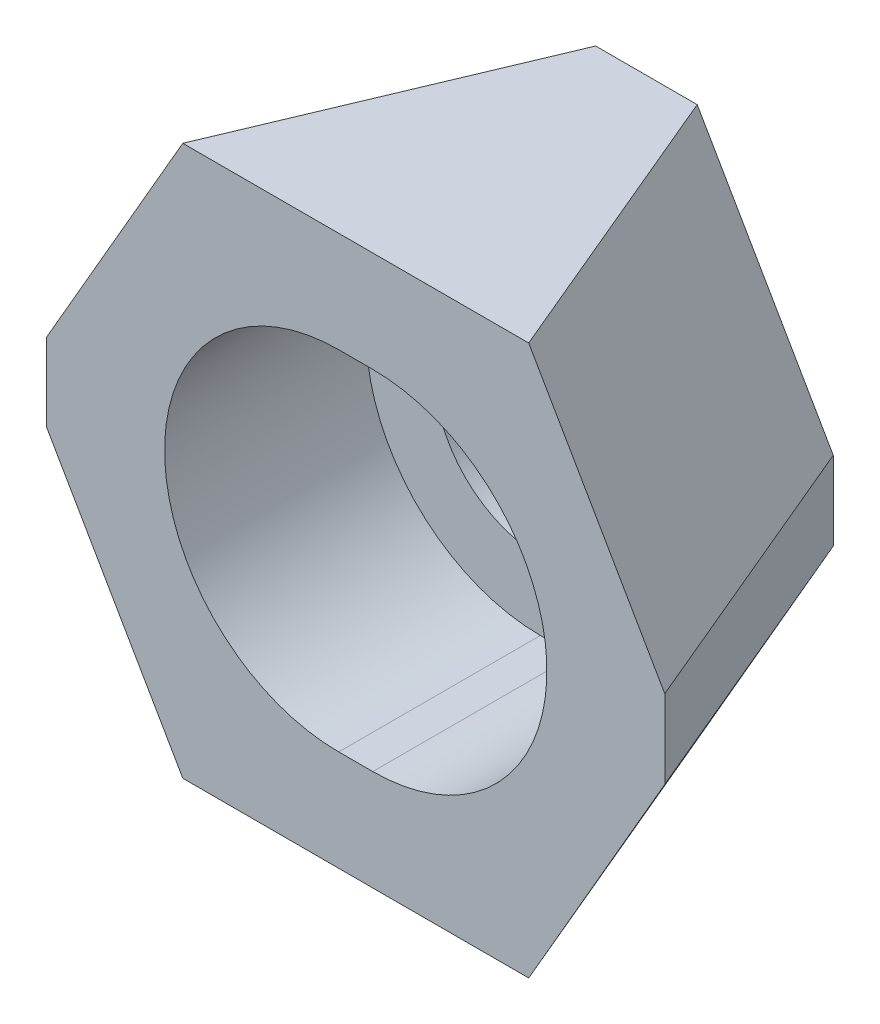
ISO-10303-21;
HEADER;
FILE_DESCRIPTION(('STEP AP214'),'2;1');
FILE_NAME('part.step','',(''),(''),'','','');
FILE_SCHEMA(('AUTOMOTIVE_DESIGN { 1 0 10303 214 1 1 1 1 }'));
ENDSEC;
DATA;
#1=APPLICATION_CONTEXT('core data for automotive mechanical design processes');
#2=APPLICATION_PROTOCOL_DEFINITION('international standard','automotive_design',2000,#1);
#3=PRODUCT_CONTEXT('',#1,'mechanical');
#4=PRODUCT('Part','Part','',(#3));
#5=PRODUCT_RELATED_PRODUCT_CATEGORY('part','',(#4));
#6=PRODUCT_DEFINITION_FORMATION('','',#4);
#7=PRODUCT_DEFINITION_CONTEXT('part definition',#1,'design');
#8=PRODUCT_DEFINITION('design','',#6,#7);
#9=PRODUCT_DEFINITION_SHAPE('','',#8);
#10=(LENGTH_UNIT() NAMED_UNIT(*) SI_UNIT(.MILLI.,.METRE.));
#11=(NAMED_UNIT(*) PLANE_ANGLE_UNIT() SI_UNIT($,.RADIAN.));
#12=(NAMED_UNIT(*) SI_UNIT($,.STERADIAN.) SOLID_ANGLE_UNIT());
#13=UNCERTAINTY_MEASURE_WITH_UNIT(LENGTH_MEASURE(1.E-05),#10,'distance_accuracy_value','');
#14=(GEOMETRIC_REPRESENTATION_CONTEXT(3) GLOBAL_UNCERTAINTY_ASSIGNED_CONTEXT((#13)) GLOBAL_UNIT_ASSIGNED_CONTEXT((#10,
#11,#12)) REPRESENTATION_CONTEXT('',''));
#15=CARTESIAN_POINT('',(0.,0.,0.));
#16=DIRECTION('',(0.,0.,1.));
#17=DIRECTION('',(1.,0.,0.));
#18=AXIS2_PLACEMENT_3D('',#15,#16,#17);
#19=CARTESIAN_POINT('',(0.65,4.05,11.1));
#20=DIRECTION('',(0.,1.,0.));
#21=DIRECTION('',(0.,0.,1.));
#22=AXIS2_PLACEMENT_3D('',#19,#20,#21);
#23=PLANE('',#22);
#24=DIRECTION('',(0.,0.,-1.));
#25=VECTOR('',#24,1.);
#26=CARTESIAN_POINT('',(-0.65,4.05,11.1));
#27=LINE('',#26,#25);
#28=CARTESIAN_POINT('',(-0.65,4.05,3.4));
#29=VERTEX_POINT('',#28);
#30=CARTESIAN_POINT('',(-0.65,4.05,0.));
#31=VERTEX_POINT('',#30);
#32=EDGE_CURVE('E215',#29,#31,#27,.T.);
#33=ORIENTED_EDGE('',*,*,#32,.T.);
#34=DIRECTION('',(1.,0.,0.));
#35=VECTOR('',#34,1.);
#36=CARTESIAN_POINT('',(0.65,4.05,0.));
#37=LINE('',#36,#35);
#38=CARTESIAN_POINT('',(0.65,4.05,0.));
#39=VERTEX_POINT('',#38);
#40=EDGE_CURVE('E233',#39,#31,#37,.F.);
#41=ORIENTED_EDGE('',*,*,#40,.F.);
#42=DIRECTION('',(0.,0.,-1.));
#43=VECTOR('',#42,1.);
#44=CARTESIAN_POINT('',(0.65,4.05,11.1));
#45=LINE('',#44,#43);
#46=CARTESIAN_POINT('',(0.65,4.05,3.4));
#47=VERTEX_POINT('',#46);
#48=EDGE_CURVE('E219',#39,#47,#45,.F.);
#49=ORIENTED_EDGE('',*,*,#48,.T.);
#50=DIRECTION('',(-1.,0.,0.));
#51=VECTOR('',#50,1.);
#52=CARTESIAN_POINT('',(0.,4.05,3.4));
#53=LINE('',#52,#51);
#54=EDGE_CURVE('E263',#47,#29,#53,.T.);
#55=ORIENTED_EDGE('',*,*,#54,.T.);
#56=EDGE_LOOP('',(#33,#41,#49,#55));
#57=FACE_BOUND('',#56,.T.);
#58=ADVANCED_FACE('F17',(#57),#23,.F.);
#59=CARTESIAN_POINT('',(-0.65,-4.05,11.1));
#60=DIRECTION('',(0.,-1.,0.));
#61=DIRECTION('',(0.,0.,-1.));
#62=AXIS2_PLACEMENT_3D('',#59,#60,#61);
#63=PLANE('',#62);
#64=DIRECTION('',(0.,0.,-1.));
#65=VECTOR('',#64,1.);
#66=CARTESIAN_POINT('',(0.65,-4.05,11.1));
#67=LINE('',#66,#65);
#68=CARTESIAN_POINT('',(0.65,-4.05,3.4));
#69=VERTEX_POINT('',#68);
#70=CARTESIAN_POINT('',(0.65,-4.05,0.));
#71=VERTEX_POINT('',#70);
#72=EDGE_CURVE('E222',#69,#71,#67,.T.);
#73=ORIENTED_EDGE('',*,*,#72,.T.);
#74=DIRECTION('',(1.,0.,0.));
#75=VECTOR('',#74,1.);
#76=CARTESIAN_POINT('',(-0.65,-4.05,0.));
#77=LINE('',#76,#75);
#78=CARTESIAN_POINT('',(-0.65,-4.05,0.));
#79=VERTEX_POINT('',#78);
#80=EDGE_CURVE('E225',#79,#71,#77,.T.);
#81=ORIENTED_EDGE('',*,*,#80,.F.);
#82=DIRECTION('',(0.,0.,-1.));
#83=VECTOR('',#82,1.);
#84=CARTESIAN_POINT('',(-0.65,-4.05,11.1));
#85=LINE('',#84,#83);
#86=CARTESIAN_POINT('',(-0.65,-4.05,3.4));
#87=VERTEX_POINT('',#86);
#88=EDGE_CURVE('E218',#79,#87,#85,.F.);
#89=ORIENTED_EDGE('',*,*,#88,.T.);
#90=DIRECTION('',(1.,0.,0.));
#91=VECTOR('',#90,1.);
#92=CARTESIAN_POINT('',(0.,-4.05,3.4));
#93=LINE('',#92,#91);
#94=EDGE_CURVE('E269',#87,#69,#93,.T.);
#95=ORIENTED_EDGE('',*,*,#94,.T.);
#96=EDGE_LOOP('',(#73,#81,#89,#95));
#97=FACE_BOUND('',#96,.T.);
#98=ADVANCED_FACE('F19',(#97),#63,.F.);
#99=CARTESIAN_POINT('',(0.,0.,3.4));
#100=DIRECTION('',(0.,0.,1.));
#101=DIRECTION('',(1.,0.,0.));
#102=AXIS2_PLACEMENT_3D('',#99,#100,#101);
#103=PLANE('',#102);
#104=ORIENTED_EDGE('',*,*,#94,.F.);
#105=CARTESIAN_POINT('',(-0.65,0.,3.4));
#106=DIRECTION('',(0.,0.,1.));
#107=DIRECTION('',(1.,0.,0.));
#108=AXIS2_PLACEMENT_3D('',#105,#106,#107);
#109=CIRCLE('',#108,4.05);
#110=EDGE_CURVE('E260',#29,#87,#109,.T.);
#111=ORIENTED_EDGE('',*,*,#110,.F.);
#112=ORIENTED_EDGE('',*,*,#54,.F.);
#113=CARTESIAN_POINT('',(0.65,0.,3.4));
#114=DIRECTION('',(0.,0.,1.));
#115=DIRECTION('',(1.,0.,0.));
#116=AXIS2_PLACEMENT_3D('',#113,#114,#115);
#117=CIRCLE('',#116,4.05);
#118=EDGE_CURVE('E266',#69,#47,#117,.T.);
#119=ORIENTED_EDGE('',*,*,#118,.F.);
#120=EDGE_LOOP('',(#104,#111,#112,#119));
#121=FACE_BOUND('',#120,.T.);
#122=CARTESIAN_POINT('',(0.65,0.,3.4));
#123=DIRECTION('',(0.,0.,1.));
#124=DIRECTION('',(1.,0.,0.));
#125=AXIS2_PLACEMENT_3D('',#122,#123,#124);
#126=CIRCLE('',#125,6.65);
#127=CARTESIAN_POINT('',(0.65,6.65,3.4));
#128=VERTEX_POINT('',#127);
#129=CARTESIAN_POINT('',(0.65,-6.65,3.4));
#130=VERTEX_POINT('',#129);
#131=EDGE_CURVE('E239',#128,#130,#126,.F.);
#132=ORIENTED_EDGE('',*,*,#131,.F.);
#133=DIRECTION('',(-1.,0.,0.));
#134=VECTOR('',#133,1.);
#135=CARTESIAN_POINT('',(0.,6.65,3.4));
#136=LINE('',#135,#134);
#137=CARTESIAN_POINT('',(-0.65,6.65,3.4));
#138=VERTEX_POINT('',#137);
#139=EDGE_CURVE('E199',#128,#138,#136,.T.);
#140=ORIENTED_EDGE('',*,*,#139,.T.);
#141=CARTESIAN_POINT('',(-0.65,0.,3.4));
#142=DIRECTION('',(0.,0.,1.));
#143=DIRECTION('',(1.,0.,0.));
#144=AXIS2_PLACEMENT_3D('',#141,#142,#143);
#145=CIRCLE('',#144,6.65);
#146=CARTESIAN_POINT('',(-0.65,-6.65,3.4));
#147=VERTEX_POINT('',#146);
#148=EDGE_CURVE('E243',#138,#147,#145,.T.);
#149=ORIENTED_EDGE('',*,*,#148,.T.);
#150=DIRECTION('',(1.,0.,0.));
#151=VECTOR('',#150,1.);
#152=CARTESIAN_POINT('',(0.,-6.65,3.4));
#153=LINE('',#152,#151);
#154=EDGE_CURVE('E221',#147,#130,#153,.T.);
#155=ORIENTED_EDGE('',*,*,#154,.T.);
#156=EDGE_LOOP('',(#132,#140,#149,#155));
#157=FACE_BOUND('',#156,.T.);
#158=ADVANCED_FACE('F353',(#121,#157),#103,.T.);
#159=CARTESIAN_POINT('',(0.65,0.,11.1));
#160=DIRECTION('',(0.,0.,-1.));
#161=DIRECTION('',(-1.,0.,0.));
#162=AXIS2_PLACEMENT_3D('',#159,#160,#161);
#163=CYLINDRICAL_SURFACE('',#162,4.05);
#164=ORIENTED_EDGE('',*,*,#48,.F.);
#165=CARTESIAN_POINT('',(0.65,0.,0.));
#166=DIRECTION('',(0.,0.,-1.));
#167=DIRECTION('',(-1.,0.,0.));
#168=AXIS2_PLACEMENT_3D('',#165,#166,#167);
#169=CIRCLE('',#168,4.05);
#170=EDGE_CURVE('E185',#39,#71,#169,.T.);
#171=ORIENTED_EDGE('',*,*,#170,.T.);
#172=ORIENTED_EDGE('',*,*,#72,.F.);
#173=ORIENTED_EDGE('',*,*,#118,.T.);
#174=EDGE_LOOP('',(#164,#171,#172,#173));
#175=FACE_BOUND('',#174,.T.);
#176=ADVANCED_FACE('F366',(#175),#163,.F.);
#177=CARTESIAN_POINT('',(-0.65,0.,11.1));
#178=DIRECTION('',(0.,0.,-1.));
#179=DIRECTION('',(-1.,0.,0.));
#180=AXIS2_PLACEMENT_3D('',#177,#178,#179);
#181=CYLINDRICAL_SURFACE('',#180,4.05);
#182=ORIENTED_EDGE('',*,*,#88,.F.);
#183=CARTESIAN_POINT('',(-0.65,0.,0.));
#184=DIRECTION('',(0.,0.,-1.));
#185=DIRECTION('',(-1.,0.,0.));
#186=AXIS2_PLACEMENT_3D('',#183,#184,#185);
#187=CIRCLE('',#186,4.05);
#188=EDGE_CURVE('E207',#79,#31,#187,.T.);
#189=ORIENTED_EDGE('',*,*,#188,.T.);
#190=ORIENTED_EDGE('',*,*,#32,.F.);
#191=ORIENTED_EDGE('',*,*,#110,.T.);
#192=EDGE_LOOP('',(#182,#189,#190,#191));
#193=FACE_BOUND('',#192,.T.);
#194=ADVANCED_FACE('F358',(#193),#181,.F.);
#195=CARTESIAN_POINT('',(-0.65,-6.65,11.1));
#196=DIRECTION('',(0.,-1.,0.));
#197=DIRECTION('',(0.,0.,-1.));
#198=AXIS2_PLACEMENT_3D('',#195,#196,#197);
#199=PLANE('',#198);
#200=DIRECTION('',(0.,0.,-1.));
#201=VECTOR('',#200,1.);
#202=CARTESIAN_POINT('',(0.65,-6.65,11.1));
#203=LINE('',#202,#201);
#204=CARTESIAN_POINT('',(0.65,-6.65,11.1));
#205=VERTEX_POINT('',#204);
#206=EDGE_CURVE('E392',#205,#130,#203,.T.);
#207=ORIENTED_EDGE('',*,*,#206,.T.);
#208=ORIENTED_EDGE('',*,*,#154,.F.);
#209=DIRECTION('',(0.,0.,-1.));
#210=VECTOR('',#209,1.);
#211=CARTESIAN_POINT('',(-0.65,-6.65,11.1));
#212=LINE('',#211,#210);
#213=CARTESIAN_POINT('',(-0.65,-6.65,11.1));
#214=VERTEX_POINT('',#213);
#215=EDGE_CURVE('E245',#147,#214,#212,.F.);
#216=ORIENTED_EDGE('',*,*,#215,.T.);
#217=DIRECTION('',(1.,0.,0.));
#218=VECTOR('',#217,1.);
#219=CARTESIAN_POINT('',(0.,-6.65,11.1));
#220=LINE('',#219,#218);
#221=EDGE_CURVE('E251',#214,#205,#220,.T.);
#222=ORIENTED_EDGE('',*,*,#221,.T.);
#223=EDGE_LOOP('',(#207,#208,#216,#222));
#224=FACE_BOUND('',#223,.T.);
#225=ADVANCED_FACE('F355',(#224),#199,.F.);
#226=CARTESIAN_POINT('',(0.65,6.65,11.1));
#227=DIRECTION('',(0.,1.,0.));
#228=DIRECTION('',(0.,0.,1.));
#229=AXIS2_PLACEMENT_3D('',#226,#227,#228);
#230=PLANE('',#229);
#231=DIRECTION('',(0.,0.,-1.));
#232=VECTOR('',#231,1.);
#233=CARTESIAN_POINT('',(-0.65,6.65,11.1));
#234=LINE('',#233,#232);
#235=CARTESIAN_POINT('',(-0.65,6.65,11.1));
#236=VERTEX_POINT('',#235);
#237=EDGE_CURVE('E159',#236,#138,#234,.T.);
#238=ORIENTED_EDGE('',*,*,#237,.T.);
#239=ORIENTED_EDGE('',*,*,#139,.F.);
#240=DIRECTION('',(0.,0.,-1.));
#241=VECTOR('',#240,1.);
#242=CARTESIAN_POINT('',(0.65,6.65,11.1));
#243=LINE('',#242,#241);
#244=CARTESIAN_POINT('',(0.65,6.65,11.1));
#245=VERTEX_POINT('',#244);
#246=EDGE_CURVE('E194',#128,#245,#243,.F.);
#247=ORIENTED_EDGE('',*,*,#246,.T.);
#248=DIRECTION('',(-1.,0.,0.));
#249=VECTOR('',#248,1.);
#250=CARTESIAN_POINT('',(0.,6.65,11.1));
#251=LINE('',#250,#249);
#252=EDGE_CURVE('E257',#245,#236,#251,.T.);
#253=ORIENTED_EDGE('',*,*,#252,.T.);
#254=EDGE_LOOP('',(#238,#239,#247,#253));
#255=FACE_BOUND('',#254,.T.);
#256=ADVANCED_FACE('F357',(#255),#230,.F.);
#257=CARTESIAN_POINT('',(9.4669948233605,5.25,5.55));
#258=DIRECTION('',(0.921863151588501,0.,-0.387515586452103));
#259=DIRECTION('',(-0.387515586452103,0.,-0.921863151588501));
#260=AXIS2_PLACEMENT_3D('',#257,#258,#259);
#261=PLANE('',#260);
#262=DIRECTION('',(0.,1.,0.));
#263=VECTOR('',#262,1.);
#264=CARTESIAN_POINT('',(11.8,0.,11.1));
#265=LINE('',#264,#263);
#266=CARTESIAN_POINT('',(11.8,1.5,11.1));
#267=VERTEX_POINT('',#266);
#268=CARTESIAN_POINT('',(11.8,-1.5,11.1));
#269=VERTEX_POINT('',#268);
#270=EDGE_CURVE('E278',#267,#269,#265,.F.);
#271=ORIENTED_EDGE('',*,*,#270,.T.);
#272=DIRECTION('',(0.387515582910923,0.000135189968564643,0.921863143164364));
#273=VECTOR('',#272,1.);
#274=CARTESIAN_POINT('',(7.133989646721,-1.50162779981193,0.));
#275=LINE('',#274,#273);
#276=CARTESIAN_POINT('',(7.133989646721,-1.50162779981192,0.));
#277=VERTEX_POINT('',#276);
#278=EDGE_CURVE('E202',#277,#269,#275,.T.);
#279=ORIENTED_EDGE('',*,*,#278,.F.);
#280=DIRECTION('',(0.,1.,0.));
#281=VECTOR('',#280,1.);
#282=CARTESIAN_POINT('',(7.133989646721,0.,0.));
#283=LINE('',#282,#281);
#284=CARTESIAN_POINT('',(7.133989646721,1.50162779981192,0.));
#285=VERTEX_POINT('',#284);
#286=EDGE_CURVE('E135',#277,#285,#283,.T.);
#287=ORIENTED_EDGE('',*,*,#286,.T.);
#288=DIRECTION('',(-0.387515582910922,0.000135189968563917,-0.921863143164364));
#289=VECTOR('',#288,1.);
#290=CARTESIAN_POINT('',(11.7604989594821,1.5000137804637,11.0060307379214));
#291=LINE('',#290,#289);
#292=EDGE_CURVE('E172',#267,#285,#291,.T.);
#293=ORIENTED_EDGE('',*,*,#292,.F.);
#294=EDGE_LOOP('',(#271,#279,#287,#293));
#295=FACE_BOUND('',#294,.T.);
#296=ADVANCED_FACE('F317',(#295),#261,.T.);
#297=CARTESIAN_POINT('',(6.3022818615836,6.9822575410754,5.55));
#298=DIRECTION('',(0.813797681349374,0.469846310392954,-0.342020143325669));
#299=DIRECTION('',(-0.5,0.866025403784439,0.));
#300=AXIS2_PLACEMENT_3D('',#297,#298,#299);
#301=PLANE('',#300);
#302=DIRECTION('',(-0.5,0.866025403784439,0.));
#303=VECTOR('',#302,1.);
#304=CARTESIAN_POINT('',(7.133989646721,1.50162779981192,0.));
#305=LINE('',#304,#303);
#306=CARTESIAN_POINT('',(1.93877703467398,10.5,0.));
#307=VERTEX_POINT('',#306);
#308=EDGE_CURVE('E186',#285,#307,#305,.T.);
#309=ORIENTED_EDGE('',*,*,#308,.T.);
#310=DIRECTION('',(-0.387449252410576,0.,-0.921891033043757));
#311=VECTOR('',#310,1.);
#312=CARTESIAN_POINT('',(6.5643544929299,10.5,11.0060307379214));
#313=LINE('',#312,#311);
#314=CARTESIAN_POINT('',(6.6038475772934,10.5,11.1));
#315=VERTEX_POINT('',#314);
#316=EDGE_CURVE('E179',#315,#307,#313,.T.);
#317=ORIENTED_EDGE('',*,*,#316,.F.);
#318=DIRECTION('',(-0.5,0.866025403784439,0.));
#319=VECTOR('',#318,1.);
#320=CARTESIAN_POINT('',(9.49951905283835,5.4845498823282,11.1));
#321=LINE('',#320,#319);
#322=EDGE_CURVE('E272',#315,#267,#321,.F.);
#323=ORIENTED_EDGE('',*,*,#322,.T.);
#324=ORIENTED_EDGE('',*,*,#292,.T.);
#325=EDGE_LOOP('',(#309,#317,#323,#324));
#326=FACE_BOUND('',#325,.T.);
#327=ADVANCED_FACE('F314',(#326),#301,.T.);
#328=CARTESIAN_POINT('',(-8.9003580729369,2.48225754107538,5.55));
#329=DIRECTION('',(-0.813797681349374,0.469846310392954,-0.342020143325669));
#330=DIRECTION('',(-0.5,-0.866025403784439,0.));
#331=AXIS2_PLACEMENT_3D('',#328,#329,#330);
#332=PLANE('',#331);
#333=DIRECTION('',(-0.5,-0.866025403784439,0.));
#334=VECTOR('',#333,1.);
#335=CARTESIAN_POINT('',(-1.93877703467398,10.5,0.));
#336=LINE('',#335,#334);
#337=CARTESIAN_POINT('',(-1.93877703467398,10.5,0.));
#338=VERTEX_POINT('',#337);
#339=CARTESIAN_POINT('',(-7.13398964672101,1.50162779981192,0.));
#340=VERTEX_POINT('',#339);
#341=EDGE_CURVE('E182',#338,#340,#336,.T.);
#342=ORIENTED_EDGE('',*,*,#341,.T.);
#343=DIRECTION('',(0.387515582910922,0.000135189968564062,-0.921863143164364));
#344=VECTOR('',#343,1.);
#345=CARTESIAN_POINT('',(-11.7604989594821,1.5000137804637,11.0060307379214));
#346=LINE('',#345,#344);
#347=CARTESIAN_POINT('',(-11.8,1.5,11.1));
#348=VERTEX_POINT('',#347);
#349=EDGE_CURVE('E168',#348,#340,#346,.T.);
#350=ORIENTED_EDGE('',*,*,#349,.F.);
#351=DIRECTION('',(0.5,0.866025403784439,0.));
#352=VECTOR('',#351,1.);
#353=CARTESIAN_POINT('',(-10.6497595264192,3.4922749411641,11.1));
#354=LINE('',#353,#352);
#355=CARTESIAN_POINT('',(-6.60384757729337,10.5,11.1));
#356=VERTEX_POINT('',#355);
#357=EDGE_CURVE('E281',#356,#348,#354,.F.);
#358=ORIENTED_EDGE('',*,*,#357,.F.);
#359=DIRECTION('',(-0.387449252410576,0.,0.921891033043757));
#360=VECTOR('',#359,1.);
#361=CARTESIAN_POINT('',(-1.93877703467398,10.5,0.));
#362=LINE('',#361,#360);
#363=EDGE_CURVE('E152',#338,#356,#362,.T.);
#364=ORIENTED_EDGE('',*,*,#363,.F.);
#365=EDGE_LOOP('',(#342,#350,#358,#364));
#366=FACE_BOUND('',#365,.T.);
#367=ADVANCED_FACE('F307',(#366),#332,.T.);
#368=CARTESIAN_POINT('',(-9.46699482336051,-5.25,5.55));
#369=DIRECTION('',(-0.921863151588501,0.,-0.387515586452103));
#370=DIRECTION('',(-0.387515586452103,0.,0.921863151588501));
#371=AXIS2_PLACEMENT_3D('',#368,#369,#370);
#372=PLANE('',#371);
#373=DIRECTION('',(0.,1.,0.));
#374=VECTOR('',#373,1.);
#375=CARTESIAN_POINT('',(-11.8,-5.25,11.1));
#376=LINE('',#375,#374);
#377=CARTESIAN_POINT('',(-11.8,-1.5,11.1));
#378=VERTEX_POINT('',#377);
#379=EDGE_CURVE('E26',#348,#378,#376,.F.);
#380=ORIENTED_EDGE('',*,*,#379,.F.);
#381=ORIENTED_EDGE('',*,*,#349,.T.);
#382=DIRECTION('',(0.,1.,0.));
#383=VECTOR('',#382,1.);
#384=CARTESIAN_POINT('',(-7.13398964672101,0.,0.));
#385=LINE('',#384,#383);
#386=CARTESIAN_POINT('',(-7.13398964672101,-1.50162779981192,0.));
#387=VERTEX_POINT('',#386);
#388=EDGE_CURVE('E136',#340,#387,#385,.F.);
#389=ORIENTED_EDGE('',*,*,#388,.T.);
#390=DIRECTION('',(0.387515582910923,-0.000135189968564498,-0.921863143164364));
#391=VECTOR('',#390,1.);
#392=CARTESIAN_POINT('',(-11.7604989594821,-1.5000137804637,11.0060307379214));
#393=LINE('',#392,#391);
#394=EDGE_CURVE('E34',#378,#387,#393,.T.);
#395=ORIENTED_EDGE('',*,*,#394,.F.);
#396=EDGE_LOOP('',(#380,#381,#389,#395));
#397=FACE_BOUND('',#396,.T.);
#398=ADVANCED_FACE('F304',(#397),#372,.T.);
#399=CARTESIAN_POINT('',(-6.30228186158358,-6.98225754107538,5.55));
#400=DIRECTION('',(-0.813797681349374,-0.469846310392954,-0.342020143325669));
#401=DIRECTION('',(0.5,-0.866025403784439,0.));
#402=AXIS2_PLACEMENT_3D('',#399,#400,#401);
#403=PLANE('',#402);
#404=DIRECTION('',(0.5,-0.866025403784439,0.));
#405=VECTOR('',#404,1.);
#406=CARTESIAN_POINT('',(-7.13398964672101,-1.50162779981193,0.));
#407=LINE('',#406,#405);
#408=CARTESIAN_POINT('',(-1.93877703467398,-10.5,0.));
#409=VERTEX_POINT('',#408);
#410=EDGE_CURVE('E130',#387,#409,#407,.T.);
#411=ORIENTED_EDGE('',*,*,#410,.T.);
#412=DIRECTION('',(0.387449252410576,0.,-0.921891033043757));
#413=VECTOR('',#412,1.);
#414=CARTESIAN_POINT('',(-6.5643544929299,-10.5,11.0060307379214));
#415=LINE('',#414,#413);
#416=CARTESIAN_POINT('',(-6.60384757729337,-10.5,11.1));
#417=VERTEX_POINT('',#416);
#418=EDGE_CURVE('E40',#417,#409,#415,.T.);
#419=ORIENTED_EDGE('',*,*,#418,.F.);
#420=DIRECTION('',(0.5,-0.866025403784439,0.));
#421=VECTOR('',#420,1.);
#422=CARTESIAN_POINT('',(-9.49951905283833,-5.48454988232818,11.1));
#423=LINE('',#422,#421);
#424=EDGE_CURVE('E11',#417,#378,#423,.F.);
#425=ORIENTED_EDGE('',*,*,#424,.T.);
#426=ORIENTED_EDGE('',*,*,#394,.T.);
#427=EDGE_LOOP('',(#411,#419,#425,#426));
#428=FACE_BOUND('',#427,.T.);
#429=ADVANCED_FACE('F132',(#428),#403,.T.);
#430=CARTESIAN_POINT('',(0.,0.,0.));
#431=DIRECTION('',(0.,0.,1.));
#432=DIRECTION('',(1.,0.,0.));
#433=AXIS2_PLACEMENT_3D('',#430,#431,#432);
#434=PLANE('',#433);
#435=ORIENTED_EDGE('',*,*,#188,.F.);
#436=ORIENTED_EDGE('',*,*,#80,.T.);
#437=ORIENTED_EDGE('',*,*,#170,.F.);
#438=ORIENTED_EDGE('',*,*,#40,.T.);
#439=EDGE_LOOP('',(#435,#436,#437,#438));
#440=FACE_BOUND('',#439,.T.);
#441=DIRECTION('',(1.,0.,0.));
#442=VECTOR('',#441,1.);
#443=CARTESIAN_POINT('',(-11.8,10.5,0.));
#444=LINE('',#443,#442);
#445=EDGE_CURVE('E155',#307,#338,#444,.F.);
#446=ORIENTED_EDGE('',*,*,#445,.F.);
#447=ORIENTED_EDGE('',*,*,#308,.F.);
#448=ORIENTED_EDGE('',*,*,#286,.F.);
#449=DIRECTION('',(0.5,0.866025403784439,0.));
#450=VECTOR('',#449,1.);
#451=CARTESIAN_POINT('',(7.1509566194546,-1.47224014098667,0.));
#452=LINE('',#451,#450);
#453=CARTESIAN_POINT('',(1.93877703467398,-10.5,0.));
#454=VERTEX_POINT('',#453);
#455=EDGE_CURVE('E143',#454,#277,#452,.T.);
#456=ORIENTED_EDGE('',*,*,#455,.F.);
#457=DIRECTION('',(1.,0.,0.));
#458=VECTOR('',#457,1.);
#459=CARTESIAN_POINT('',(11.8,-10.5,0.));
#460=LINE('',#459,#458);
#461=EDGE_CURVE('E139',#409,#454,#460,.T.);
#462=ORIENTED_EDGE('',*,*,#461,.F.);
#463=ORIENTED_EDGE('',*,*,#410,.F.);
#464=ORIENTED_EDGE('',*,*,#388,.F.);
#465=ORIENTED_EDGE('',*,*,#341,.F.);
#466=EDGE_LOOP('',(#446,#447,#448,#456,#462,#463,#464,#465));
#467=FACE_BOUND('',#466,.T.);
#468=ADVANCED_FACE('F141',(#440,#467),#434,.F.);
#469=CARTESIAN_POINT('',(8.9003580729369,-2.48225754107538,5.55));
#470=DIRECTION('',(0.813797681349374,-0.469846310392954,-0.342020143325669));
#471=DIRECTION('',(0.5,0.866025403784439,0.));
#472=AXIS2_PLACEMENT_3D('',#469,#470,#471);
#473=PLANE('',#472);
#474=ORIENTED_EDGE('',*,*,#455,.T.);
#475=ORIENTED_EDGE('',*,*,#278,.T.);
#476=DIRECTION('',(-0.5,-0.866025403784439,0.));
#477=VECTOR('',#476,1.);
#478=CARTESIAN_POINT('',(10.6497595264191,-3.49227494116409,11.1));
#479=LINE('',#478,#477);
#480=CARTESIAN_POINT('',(6.6038475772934,-10.5,11.1));
#481=VERTEX_POINT('',#480);
#482=EDGE_CURVE('E275',#481,#269,#479,.F.);
#483=ORIENTED_EDGE('',*,*,#482,.F.);
#484=DIRECTION('',(0.387449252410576,0.,0.921891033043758));
#485=VECTOR('',#484,1.);
#486=CARTESIAN_POINT('',(1.93877703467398,-10.5,0.));
#487=LINE('',#486,#485);
#488=EDGE_CURVE('E147',#454,#481,#487,.T.);
#489=ORIENTED_EDGE('',*,*,#488,.F.);
#490=EDGE_LOOP('',(#474,#475,#483,#489));
#491=FACE_BOUND('',#490,.T.);
#492=ADVANCED_FACE('F321',(#491),#473,.T.);
#493=CARTESIAN_POINT('',(-0.65,0.,11.1));
#494=DIRECTION('',(0.,0.,-1.));
#495=DIRECTION('',(-1.,0.,0.));
#496=AXIS2_PLACEMENT_3D('',#493,#494,#495);
#497=CYLINDRICAL_SURFACE('',#496,6.65);
#498=ORIENTED_EDGE('',*,*,#215,.F.);
#499=ORIENTED_EDGE('',*,*,#148,.F.);
#500=ORIENTED_EDGE('',*,*,#237,.F.);
#501=CARTESIAN_POINT('',(-0.65,0.,11.1));
#502=DIRECTION('',(0.,0.,1.));
#503=DIRECTION('',(1.,0.,0.));
#504=AXIS2_PLACEMENT_3D('',#501,#502,#503);
#505=CIRCLE('',#504,6.65);
#506=EDGE_CURVE('E254',#236,#214,#505,.T.);
#507=ORIENTED_EDGE('',*,*,#506,.T.);
#508=EDGE_LOOP('',(#498,#499,#500,#507));
#509=FACE_BOUND('',#508,.T.);
#510=ADVANCED_FACE('F323',(#509),#497,.F.);
#511=CARTESIAN_POINT('',(0.65,0.,11.1));
#512=DIRECTION('',(0.,0.,-1.));
#513=DIRECTION('',(-1.,0.,0.));
#514=AXIS2_PLACEMENT_3D('',#511,#512,#513);
#515=CYLINDRICAL_SURFACE('',#514,6.65);
#516=ORIENTED_EDGE('',*,*,#246,.F.);
#517=ORIENTED_EDGE('',*,*,#131,.T.);
#518=ORIENTED_EDGE('',*,*,#206,.F.);
#519=CARTESIAN_POINT('',(0.65,0.,11.1));
#520=DIRECTION('',(0.,0.,1.));
#521=DIRECTION('',(1.,0.,0.));
#522=AXIS2_PLACEMENT_3D('',#519,#520,#521);
#523=CIRCLE('',#522,6.65);
#524=EDGE_CURVE('E248',#205,#245,#523,.T.);
#525=ORIENTED_EDGE('',*,*,#524,.T.);
#526=EDGE_LOOP('',(#516,#517,#518,#525));
#527=FACE_BOUND('',#526,.T.);
#528=ADVANCED_FACE('F330',(#527),#515,.F.);
#529=CARTESIAN_POINT('',(-11.8,10.5,0.));
#530=DIRECTION('',(0.,1.,0.));
#531=DIRECTION('',(0.,0.,1.));
#532=AXIS2_PLACEMENT_3D('',#529,#530,#531);
#533=PLANE('',#532);
#534=ORIENTED_EDGE('',*,*,#363,.T.);
#535=DIRECTION('',(1.,0.,0.));
#536=VECTOR('',#535,1.);
#537=CARTESIAN_POINT('',(0.,10.5,11.1));
#538=LINE('',#537,#536);
#539=EDGE_CURVE('E164',#315,#356,#538,.F.);
#540=ORIENTED_EDGE('',*,*,#539,.F.);
#541=ORIENTED_EDGE('',*,*,#316,.T.);
#542=ORIENTED_EDGE('',*,*,#445,.T.);
#543=EDGE_LOOP('',(#534,#540,#541,#542));
#544=FACE_BOUND('',#543,.T.);
#545=ADVANCED_FACE('F311',(#544),#533,.T.);
#546=CARTESIAN_POINT('',(11.8,-10.5,0.));
#547=DIRECTION('',(0.,-1.,0.));
#548=DIRECTION('',(0.,0.,-1.));
#549=AXIS2_PLACEMENT_3D('',#546,#547,#548);
#550=PLANE('',#549);
#551=ORIENTED_EDGE('',*,*,#461,.T.);
#552=ORIENTED_EDGE('',*,*,#488,.T.);
#553=DIRECTION('',(1.,0.,0.));
#554=VECTOR('',#553,1.);
#555=CARTESIAN_POINT('',(0.,-10.5,11.1));
#556=LINE('',#555,#554);
#557=EDGE_CURVE('E150',#417,#481,#556,.T.);
#558=ORIENTED_EDGE('',*,*,#557,.F.);
#559=ORIENTED_EDGE('',*,*,#418,.T.);
#560=EDGE_LOOP('',(#551,#552,#558,#559));
#561=FACE_BOUND('',#560,.T.);
#562=ADVANCED_FACE('F149',(#561),#550,.T.);
#563=CARTESIAN_POINT('',(0.,0.,11.1));
#564=DIRECTION('',(0.,0.,1.));
#565=DIRECTION('',(1.,0.,0.));
#566=AXIS2_PLACEMENT_3D('',#563,#564,#565);
#567=PLANE('',#566);
#568=ORIENTED_EDGE('',*,*,#424,.F.);
#569=ORIENTED_EDGE('',*,*,#557,.T.);
#570=ORIENTED_EDGE('',*,*,#482,.T.);
#571=ORIENTED_EDGE('',*,*,#270,.F.);
#572=ORIENTED_EDGE('',*,*,#322,.F.);
#573=ORIENTED_EDGE('',*,*,#539,.T.);
#574=ORIENTED_EDGE('',*,*,#357,.T.);
#575=ORIENTED_EDGE('',*,*,#379,.T.);
#576=EDGE_LOOP('',(#568,#569,#570,#571,#572,#573,#574,#575));
#577=FACE_BOUND('',#576,.T.);
#578=ORIENTED_EDGE('',*,*,#252,.F.);
#579=ORIENTED_EDGE('',*,*,#524,.F.);
#580=ORIENTED_EDGE('',*,*,#221,.F.);
#581=ORIENTED_EDGE('',*,*,#506,.F.);
#582=EDGE_LOOP('',(#578,#579,#580,#581));
#583=FACE_BOUND('',#582,.T.);
#584=ADVANCED_FACE('F301',(#577,#583),#567,.T.);
#585=CLOSED_SHELL('',(#58,#98,#158,#176,#194,#225,#256,#296,#327,#367,#398,#429,#468,#492,#510,
#528,#545,#562,#584));
#586=MANIFOLD_SOLID_BREP('B1',#585);
#587=ADVANCED_BREP_SHAPE_REPRESENTATION('',(#18,#586),#14);
#588=SHAPE_DEFINITION_REPRESENTATION(#9,#587);
ENDSEC;
END-ISO-10303-21;
